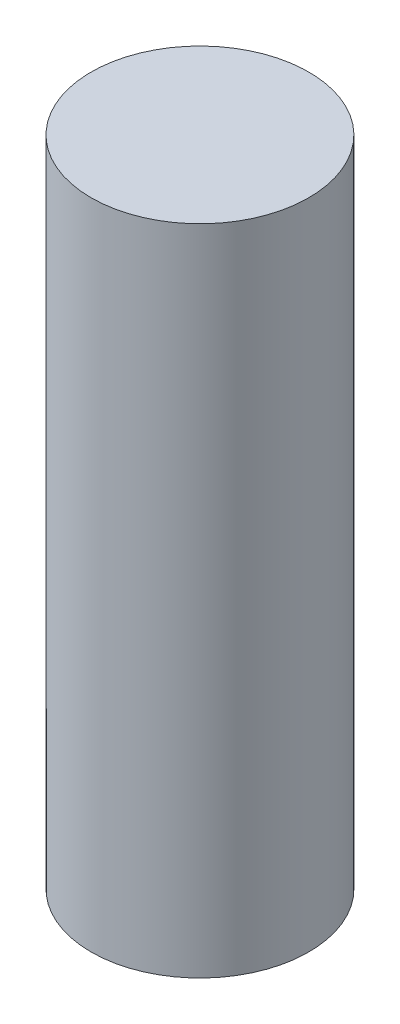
ISO-10303-21;
HEADER;
FILE_DESCRIPTION(('STEP AP214'),'2;1');
FILE_NAME('part.step','',(''),(''),'','','');
FILE_SCHEMA(('AUTOMOTIVE_DESIGN { 1 0 10303 214 1 1 1 1 }'));
ENDSEC;
DATA;
#1=APPLICATION_CONTEXT('core data for automotive mechanical design processes');
#2=APPLICATION_PROTOCOL_DEFINITION('international standard','automotive_design',2000,#1);
#3=PRODUCT_CONTEXT('',#1,'mechanical');
#4=PRODUCT('Part','Part','',(#3));
#5=PRODUCT_RELATED_PRODUCT_CATEGORY('part','',(#4));
#6=PRODUCT_DEFINITION_FORMATION('','',#4);
#7=PRODUCT_DEFINITION_CONTEXT('part definition',#1,'design');
#8=PRODUCT_DEFINITION('design','',#6,#7);
#9=PRODUCT_DEFINITION_SHAPE('','',#8);
#10=(LENGTH_UNIT() NAMED_UNIT(*) SI_UNIT(.MILLI.,.METRE.));
#11=(NAMED_UNIT(*) PLANE_ANGLE_UNIT() SI_UNIT($,.RADIAN.));
#12=(NAMED_UNIT(*) SI_UNIT($,.STERADIAN.) SOLID_ANGLE_UNIT());
#13=UNCERTAINTY_MEASURE_WITH_UNIT(LENGTH_MEASURE(1.E-05),#10,'distance_accuracy_value','');
#14=(GEOMETRIC_REPRESENTATION_CONTEXT(3) GLOBAL_UNCERTAINTY_ASSIGNED_CONTEXT((#13)) GLOBAL_UNIT_ASSIGNED_CONTEXT((#10,
#11,#12)) REPRESENTATION_CONTEXT('',''));
#15=CARTESIAN_POINT('',(0.,0.,0.));
#16=DIRECTION('',(0.,0.,1.));
#17=DIRECTION('',(1.,0.,0.));
#18=AXIS2_PLACEMENT_3D('',#15,#16,#17);
#19=CARTESIAN_POINT('',(0.,6.,0.));
#20=DIRECTION('',(0.,-1.,0.));
#21=DIRECTION('',(0.,0.,-1.));
#22=AXIS2_PLACEMENT_3D('',#19,#20,#21);
#23=CYLINDRICAL_SURFACE('',#22,1.);
#24=CARTESIAN_POINT('',(0.,6.,0.));
#25=DIRECTION('',(0.,1.,0.));
#26=DIRECTION('',(0.,0.,1.));
#27=AXIS2_PLACEMENT_3D('',#24,#25,#26);
#28=CIRCLE('',#27,1.);
#29=CARTESIAN_POINT('',(0.,6.,1.));
#30=VERTEX_POINT('',#29);
#31=EDGE_CURVE('E10',#30,#30,#28,.T.);
#32=ORIENTED_EDGE('',*,*,#31,.F.);
#33=EDGE_LOOP('',(#32));
#34=FACE_BOUND('',#33,.T.);
#35=CARTESIAN_POINT('',(0.,0.,0.));
#36=DIRECTION('',(0.,1.,0.));
#37=DIRECTION('',(0.,0.,1.));
#38=AXIS2_PLACEMENT_3D('',#35,#36,#37);
#39=CIRCLE('',#38,1.);
#40=CARTESIAN_POINT('',(0.,0.,1.));
#41=VERTEX_POINT('',#40);
#42=EDGE_CURVE('E33',#41,#41,#39,.T.);
#43=ORIENTED_EDGE('',*,*,#42,.T.);
#44=EDGE_LOOP('',(#43));
#45=FACE_BOUND('',#44,.T.);
#46=ADVANCED_FACE('F30',(#34,#45),#23,.T.);
#47=CARTESIAN_POINT('',(0.,6.,0.));
#48=DIRECTION('',(0.,1.,0.));
#49=DIRECTION('',(0.,0.,1.));
#50=AXIS2_PLACEMENT_3D('',#47,#48,#49);
#51=PLANE('',#50);
#52=ORIENTED_EDGE('',*,*,#31,.T.);
#53=EDGE_LOOP('',(#52));
#54=FACE_BOUND('',#53,.T.);
#55=ADVANCED_FACE('F45',(#54),#51,.T.);
#56=CARTESIAN_POINT('',(0.,0.,0.));
#57=DIRECTION('',(0.,1.,0.));
#58=DIRECTION('',(0.,0.,1.));
#59=AXIS2_PLACEMENT_3D('',#56,#57,#58);
#60=PLANE('',#59);
#61=ORIENTED_EDGE('',*,*,#42,.F.);
#62=EDGE_LOOP('',(#61));
#63=FACE_BOUND('',#62,.T.);
#64=ADVANCED_FACE('F43',(#63),#60,.F.);
#65=CLOSED_SHELL('',(#46,#55,#64));
#66=MANIFOLD_SOLID_BREP('B2',#65);
#67=ADVANCED_BREP_SHAPE_REPRESENTATION('',(#18,#66),#14);
#68=SHAPE_DEFINITION_REPRESENTATION(#9,#67);
ENDSEC;
END-ISO-10303-21;
